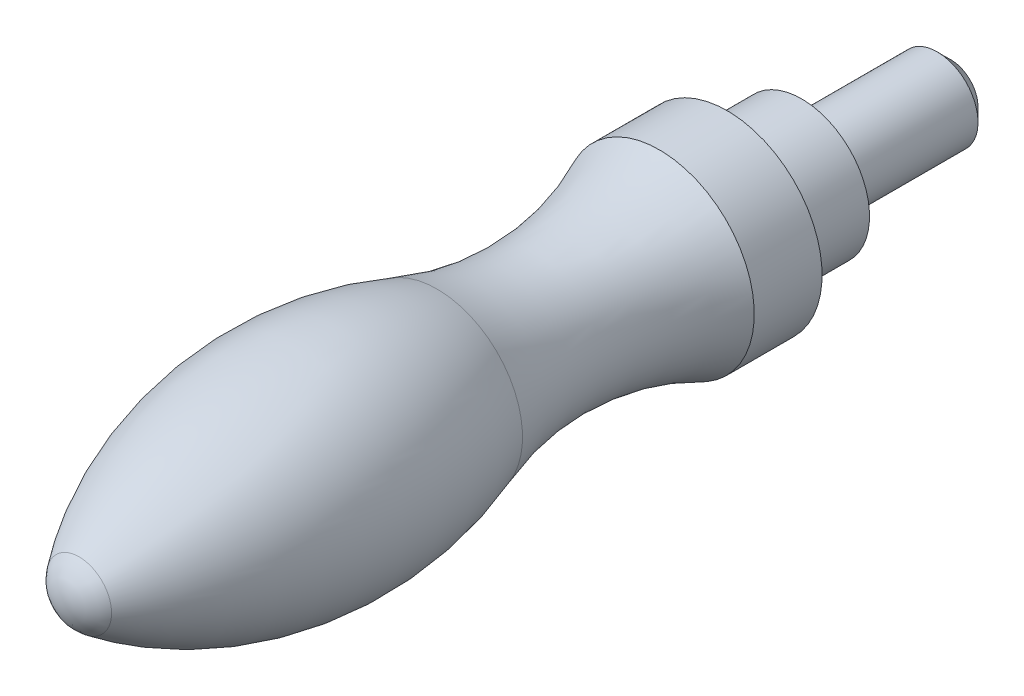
ISO-10303-21;
HEADER;
FILE_DESCRIPTION(('STEP AP214'),'2;1');
FILE_NAME('part.step','',(''),(''),'','','');
FILE_SCHEMA(('AUTOMOTIVE_DESIGN { 1 0 10303 214 1 1 1 1 }'));
ENDSEC;
DATA;
#1=APPLICATION_CONTEXT('core data for automotive mechanical design processes');
#2=APPLICATION_PROTOCOL_DEFINITION('international standard','automotive_design',2000,#1);
#3=PRODUCT_CONTEXT('',#1,'mechanical');
#4=PRODUCT('Part','Part','',(#3));
#5=PRODUCT_RELATED_PRODUCT_CATEGORY('part','',(#4));
#6=PRODUCT_DEFINITION_FORMATION('','',#4);
#7=PRODUCT_DEFINITION_CONTEXT('part definition',#1,'design');
#8=PRODUCT_DEFINITION('design','',#6,#7);
#9=PRODUCT_DEFINITION_SHAPE('','',#8);
#10=(LENGTH_UNIT() NAMED_UNIT(*) SI_UNIT(.MILLI.,.METRE.));
#11=(NAMED_UNIT(*) PLANE_ANGLE_UNIT() SI_UNIT($,.RADIAN.));
#12=(NAMED_UNIT(*) SI_UNIT($,.STERADIAN.) SOLID_ANGLE_UNIT());
#13=UNCERTAINTY_MEASURE_WITH_UNIT(LENGTH_MEASURE(1.E-05),#10,'distance_accuracy_value','');
#14=(GEOMETRIC_REPRESENTATION_CONTEXT(3) GLOBAL_UNCERTAINTY_ASSIGNED_CONTEXT((#13)) GLOBAL_UNIT_ASSIGNED_CONTEXT((#10,
#11,#12)) REPRESENTATION_CONTEXT('',''));
#15=CARTESIAN_POINT('',(0.,0.,0.));
#16=DIRECTION('',(0.,0.,1.));
#17=DIRECTION('',(1.,0.,0.));
#18=AXIS2_PLACEMENT_3D('',#15,#16,#17);
#19=CARTESIAN_POINT('',(0.000499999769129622,0.,51.4999990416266));
#20=DIRECTION('',(0.,-1.,0.));
#21=DIRECTION('',(-1.,0.,0.));
#22=AXIS2_PLACEMENT_3D('',#19,#20,#21);
#23=CIRCLE('',#22,3.00000100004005);
#24=TRIMMED_CURVE('',#23,(PARAMETER_VALUE(-1.57062966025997)),
(PARAMETER_VALUE(1.57062966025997)),.T.,.PARAMETER.);
#25=CARTESIAN_POINT('',(0.,0.,51.4999990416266));
#26=DIRECTION('',(0.,0.,-1.));
#27=AXIS1_PLACEMENT('',#25,#26);
#28=SURFACE_OF_REVOLUTION('',#24,#27);
#29=CARTESIAN_POINT('',(0.,0.,53.299998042));
#30=DIRECTION('',(0.,0.,-1.));
#31=DIRECTION('',(-1.,0.,0.));
#32=AXIS2_PLACEMENT_3D('',#29,#30,#31);
#33=CIRCLE('',#32,2.399502);
#34=CARTESIAN_POINT('',(-2.399502,0.,53.299998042));
#35=VERTEX_POINT('',#34);
#36=EDGE_CURVE('E9',#35,#35,#33,.T.);
#37=ORIENTED_EDGE('',*,*,#36,.F.);
#38=EDGE_LOOP('',(#37));
#39=FACE_BOUND('',#38,.T.);
#40=CARTESIAN_POINT('',(0.,0.,54.5));
#41=VERTEX_POINT('',#40);
#42=VERTEX_LOOP('',#41);
#43=FACE_BOUND('',#42,.T.);
#44=ADVANCED_FACE('F14',(#39,#43),#28,.T.);
#45=CARTESIAN_POINT('',(0.,0.,36.499999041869));
#46=DIRECTION('',(0.,0.,-1.));
#47=DIRECTION('',(-1.,0.,0.));
#48=AXIS2_PLACEMENT_3D('',#45,#46,#47);
#49=DEGENERATE_TOROIDAL_SURFACE('',#48,20.0005000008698,28.0000010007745,.F.);
#50=CARTESIAN_POINT('',(0.,0.,26.894354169));
#51=DIRECTION('',(0.,0.,-1.));
#52=DIRECTION('',(-1.,0.,0.));
#53=AXIS2_PLACEMENT_3D('',#50,#51,#52);
#54=CIRCLE('',#53,6.30029167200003);
#55=CARTESIAN_POINT('',(-6.30029167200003,0.,26.894354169));
#56=VERTEX_POINT('',#55);
#57=EDGE_CURVE('E21',#56,#56,#54,.T.);
#58=ORIENTED_EDGE('',*,*,#57,.F.);
#59=EDGE_LOOP('',(#58));
#60=FACE_BOUND('',#59,.T.);
#61=ORIENTED_EDGE('',*,*,#36,.T.);
#62=EDGE_LOOP('',(#61));
#63=FACE_BOUND('',#62,.T.);
#64=ADVANCED_FACE('F145',(#60,#63),#49,.F.);
#65=CARTESIAN_POINT('',(0.,0.,19.5409677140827));
#66=DIRECTION('',(0.,0.,-1.));
#67=DIRECTION('',(-1.,0.,0.));
#68=AXIS2_PLACEMENT_3D('',#65,#66,#67);
#69=TOROIDAL_SURFACE('',#68,26.4342741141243,21.4347741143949);
#70=CARTESIAN_POINT('',(0.,0.,10.500000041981));
#71=DIRECTION('',(0.,0.,-1.));
#72=DIRECTION('',(-1.,0.,0.));
#73=AXIS2_PLACEMENT_3D('',#70,#71,#72);
#74=CIRCLE('',#73,6.99949999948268);
#75=CARTESIAN_POINT('',(-6.99949999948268,0.,10.500000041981));
#76=VERTEX_POINT('',#75);
#77=EDGE_CURVE('E138',#76,#76,#74,.T.);
#78=ORIENTED_EDGE('',*,*,#77,.F.);
#79=EDGE_LOOP('',(#78));
#80=FACE_BOUND('',#79,.T.);
#81=ORIENTED_EDGE('',*,*,#57,.T.);
#82=EDGE_LOOP('',(#81));
#83=FACE_BOUND('',#82,.T.);
#84=ADVANCED_FACE('F143',(#80,#83),#69,.F.);
#85=CARTESIAN_POINT('',(0.,0.,-17.6175976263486));
#86=DIRECTION('',(0.,0.,-1.));
#87=DIRECTION('',(-1.,0.,0.));
#88=AXIS2_PLACEMENT_3D('',#85,#86,#87);
#89=CYLINDRICAL_SURFACE('',#88,6.99949999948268);
#90=CARTESIAN_POINT('',(0.,0.,5.5));
#91=DIRECTION('',(0.,0.,-1.));
#92=DIRECTION('',(-1.,0.,0.));
#93=AXIS2_PLACEMENT_3D('',#90,#91,#92);
#94=CIRCLE('',#93,6.99949999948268);
#95=CARTESIAN_POINT('',(-6.99949999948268,0.,5.5));
#96=VERTEX_POINT('',#95);
#97=EDGE_CURVE('E135',#96,#96,#94,.T.);
#98=ORIENTED_EDGE('',*,*,#97,.F.);
#99=EDGE_LOOP('',(#98));
#100=FACE_BOUND('',#99,.T.);
#101=ORIENTED_EDGE('',*,*,#77,.T.);
#102=EDGE_LOOP('',(#101));
#103=FACE_BOUND('',#102,.T.);
#104=ADVANCED_FACE('F166',(#100,#103),#89,.T.);
#105=CARTESIAN_POINT('',(0.,6.99949999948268,5.5));
#106=DIRECTION('',(0.,0.,1.));
#107=DIRECTION('',(1.,0.,0.));
#108=AXIS2_PLACEMENT_3D('',#105,#106,#107);
#109=PLANE('',#108);
#110=CARTESIAN_POINT('',(0.,0.,5.5));
#111=DIRECTION('',(0.,0.,-1.));
#112=DIRECTION('',(-1.,0.,0.));
#113=AXIS2_PLACEMENT_3D('',#110,#111,#112);
#114=CIRCLE('',#113,4.9995);
#115=CARTESIAN_POINT('',(-4.9995,0.,5.5));
#116=VERTEX_POINT('',#115);
#117=EDGE_CURVE('E132',#116,#116,#114,.T.);
#118=ORIENTED_EDGE('',*,*,#117,.F.);
#119=EDGE_LOOP('',(#118));
#120=FACE_BOUND('',#119,.T.);
#121=ORIENTED_EDGE('',*,*,#97,.T.);
#122=EDGE_LOOP('',(#121));
#123=FACE_BOUND('',#122,.T.);
#124=ADVANCED_FACE('F174',(#120,#123),#109,.F.);
#125=CARTESIAN_POINT('',(0.,0.,-17.6175976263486));
#126=DIRECTION('',(0.,0.,-1.));
#127=DIRECTION('',(-1.,0.,0.));
#128=AXIS2_PLACEMENT_3D('',#125,#126,#127);
#129=CYLINDRICAL_SURFACE('',#128,4.9995);
#130=CARTESIAN_POINT('',(0.,0.,0.));
#131=DIRECTION('',(0.,0.,-1.));
#132=DIRECTION('',(-1.,0.,0.));
#133=AXIS2_PLACEMENT_3D('',#130,#131,#132);
#134=CIRCLE('',#133,4.9995);
#135=CARTESIAN_POINT('',(-4.9995,0.,0.));
#136=VERTEX_POINT('',#135);
#137=EDGE_CURVE('E129',#136,#136,#134,.T.);
#138=ORIENTED_EDGE('',*,*,#137,.F.);
#139=EDGE_LOOP('',(#138));
#140=FACE_BOUND('',#139,.T.);
#141=ORIENTED_EDGE('',*,*,#117,.T.);
#142=EDGE_LOOP('',(#141));
#143=FACE_BOUND('',#142,.T.);
#144=ADVANCED_FACE('F182',(#140,#143),#129,.T.);
#145=CARTESIAN_POINT('',(0.,4.9995,0.));
#146=DIRECTION('',(0.,0.,1.));
#147=DIRECTION('',(1.,0.,0.));
#148=AXIS2_PLACEMENT_3D('',#145,#146,#147);
#149=PLANE('',#148);
#150=CARTESIAN_POINT('',(0.,0.,0.));
#151=DIRECTION('',(0.,0.,-1.));
#152=DIRECTION('',(-1.,0.,0.));
#153=AXIS2_PLACEMENT_3D('',#150,#151,#152);
#154=CIRCLE('',#153,2.9995);
#155=CARTESIAN_POINT('',(-2.9995,0.,0.));
#156=VERTEX_POINT('',#155);
#157=EDGE_CURVE('E126',#156,#156,#154,.T.);
#158=ORIENTED_EDGE('',*,*,#157,.F.);
#159=EDGE_LOOP('',(#158));
#160=FACE_BOUND('',#159,.T.);
#161=ORIENTED_EDGE('',*,*,#137,.T.);
#162=EDGE_LOOP('',(#161));
#163=FACE_BOUND('',#162,.T.);
#164=ADVANCED_FACE('F190',(#160,#163),#149,.F.);
#165=CARTESIAN_POINT('',(0.,0.,-17.6175976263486));
#166=DIRECTION('',(0.,0.,-1.));
#167=DIRECTION('',(-1.,0.,0.));
#168=AXIS2_PLACEMENT_3D('',#165,#166,#167);
#169=CYLINDRICAL_SURFACE('',#168,2.9995);
#170=CARTESIAN_POINT('',(0.,0.,-10.));
#171=DIRECTION('',(0.,0.,-1.));
#172=DIRECTION('',(-1.,0.,0.));
#173=AXIS2_PLACEMENT_3D('',#170,#171,#172);
#174=CIRCLE('',#173,2.9995);
#175=CARTESIAN_POINT('',(-2.9995,0.,-10.));
#176=VERTEX_POINT('',#175);
#177=EDGE_CURVE('E123',#176,#176,#174,.T.);
#178=ORIENTED_EDGE('',*,*,#177,.F.);
#179=EDGE_LOOP('',(#178));
#180=FACE_BOUND('',#179,.T.);
#181=ORIENTED_EDGE('',*,*,#157,.T.);
#182=EDGE_LOOP('',(#181));
#183=FACE_BOUND('',#182,.T.);
#184=ADVANCED_FACE('F198',(#180,#183),#169,.T.);
#185=CARTESIAN_POINT('',(0.,0.,-10.));
#186=DIRECTION('',(0.,0.,1.));
#187=DIRECTION('',(1.,0.,0.));
#188=AXIS2_PLACEMENT_3D('',#185,#186,#187);
#189=CONICAL_SURFACE('',#188,2.9995,0.78539816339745);
#190=CARTESIAN_POINT('',(0.,0.,-11.));
#191=DIRECTION('',(0.,0.,-1.));
#192=DIRECTION('',(-1.,0.,0.));
#193=AXIS2_PLACEMENT_3D('',#190,#191,#192);
#194=CIRCLE('',#193,1.9995);
#195=CARTESIAN_POINT('',(-1.9995,0.,-11.));
#196=VERTEX_POINT('',#195);
#197=EDGE_CURVE('E113',#196,#196,#194,.T.);
#198=ORIENTED_EDGE('',*,*,#197,.F.);
#199=EDGE_LOOP('',(#198));
#200=FACE_BOUND('',#199,.T.);
#201=ORIENTED_EDGE('',*,*,#177,.T.);
#202=EDGE_LOOP('',(#201));
#203=FACE_BOUND('',#202,.T.);
#204=ADVANCED_FACE('F206',(#200,#203),#189,.T.);
#205=CARTESIAN_POINT('',(0.,1.9995,-11.));
#206=DIRECTION('',(0.,0.,1.));
#207=DIRECTION('',(1.,0.,0.));
#208=AXIS2_PLACEMENT_3D('',#205,#206,#207);
#209=PLANE('',#208);
#210=DIRECTION('',(0.866025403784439,-0.5,0.));
#211=VECTOR('',#210,1.);
#212=CARTESIAN_POINT('',(0.,1.73205080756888,-11.));
#213=LINE('',#212,#211);
#214=CARTESIAN_POINT('',(0.,1.73205080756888,-11.));
#215=VERTEX_POINT('',#214);
#216=CARTESIAN_POINT('',(1.5,0.866025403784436,-11.));
#217=VERTEX_POINT('',#216);
#218=EDGE_CURVE('E101',#215,#217,#213,.T.);
#219=ORIENTED_EDGE('',*,*,#218,.F.);
#220=DIRECTION('',(0.866025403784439,0.5,0.));
#221=VECTOR('',#220,1.);
#222=CARTESIAN_POINT('',(-1.5,0.866025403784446,-11.));
#223=LINE('',#222,#221);
#224=CARTESIAN_POINT('',(-1.5,0.866025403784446,-11.));
#225=VERTEX_POINT('',#224);
#226=EDGE_CURVE('E28',#225,#215,#223,.T.);
#227=ORIENTED_EDGE('',*,*,#226,.F.);
#228=DIRECTION('',(0.,1.,0.));
#229=VECTOR('',#228,1.);
#230=CARTESIAN_POINT('',(-1.5,-0.866025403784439,-11.));
#231=LINE('',#230,#229);
#232=CARTESIAN_POINT('',(-1.5,-0.866025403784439,-11.));
#233=VERTEX_POINT('',#232);
#234=EDGE_CURVE('E87',#233,#225,#231,.T.);
#235=ORIENTED_EDGE('',*,*,#234,.F.);
#236=DIRECTION('',(-0.866025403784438,0.5,0.));
#237=VECTOR('',#236,1.);
#238=CARTESIAN_POINT('',(0.,-1.73205080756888,-11.));
#239=LINE('',#238,#237);
#240=CARTESIAN_POINT('',(0.,-1.73205080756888,-11.));
#241=VERTEX_POINT('',#240);
#242=EDGE_CURVE('E90',#241,#233,#239,.T.);
#243=ORIENTED_EDGE('',*,*,#242,.F.);
#244=DIRECTION('',(-0.866025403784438,-0.5,0.));
#245=VECTOR('',#244,1.);
#246=CARTESIAN_POINT('',(1.5,-0.866025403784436,-11.));
#247=LINE('',#246,#245);
#248=CARTESIAN_POINT('',(1.5,-0.866025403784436,-11.));
#249=VERTEX_POINT('',#248);
#250=EDGE_CURVE('E106',#249,#241,#247,.T.);
#251=ORIENTED_EDGE('',*,*,#250,.F.);
#252=DIRECTION('',(0.,-1.,0.));
#253=VECTOR('',#252,1.);
#254=CARTESIAN_POINT('',(1.5,0.866025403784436,-11.));
#255=LINE('',#254,#253);
#256=EDGE_CURVE('E103',#217,#249,#255,.T.);
#257=ORIENTED_EDGE('',*,*,#256,.F.);
#258=EDGE_LOOP('',(#219,#227,#235,#243,#251,#257));
#259=FACE_BOUND('',#258,.T.);
#260=ORIENTED_EDGE('',*,*,#197,.T.);
#261=EDGE_LOOP('',(#260));
#262=FACE_BOUND('',#261,.T.);
#263=ADVANCED_FACE('F214',(#259,#262),#209,.F.);
#264=CARTESIAN_POINT('',(-1.5,0.866025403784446,-8.));
#265=DIRECTION('',(-0.5,0.866025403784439,0.));
#266=DIRECTION('',(-0.866025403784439,-0.5,0.));
#267=AXIS2_PLACEMENT_3D('',#264,#265,#266);
#268=PLANE('',#267);
#269=ORIENTED_EDGE('',*,*,#226,.T.);
#270=DIRECTION('',(0.,0.,-1.));
#271=VECTOR('',#270,1.);
#272=CARTESIAN_POINT('',(0.,1.73205080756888,-8.));
#273=LINE('',#272,#271);
#274=CARTESIAN_POINT('',(0.,1.73205080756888,-8.));
#275=VERTEX_POINT('',#274);
#276=EDGE_CURVE('E64',#275,#215,#273,.T.);
#277=ORIENTED_EDGE('',*,*,#276,.F.);
#278=DIRECTION('',(0.866025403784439,0.5,0.));
#279=VECTOR('',#278,1.);
#280=CARTESIAN_POINT('',(-1.5,0.866025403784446,-8.));
#281=LINE('',#280,#279);
#282=CARTESIAN_POINT('',(-1.5,0.866025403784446,-8.));
#283=VERTEX_POINT('',#282);
#284=EDGE_CURVE('E68',#283,#275,#281,.T.);
#285=ORIENTED_EDGE('',*,*,#284,.F.);
#286=DIRECTION('',(0.,0.,-1.));
#287=VECTOR('',#286,1.);
#288=CARTESIAN_POINT('',(-1.5,0.866025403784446,-8.));
#289=LINE('',#288,#287);
#290=EDGE_CURVE('E111',#283,#225,#289,.T.);
#291=ORIENTED_EDGE('',*,*,#290,.T.);
#292=EDGE_LOOP('',(#269,#277,#285,#291));
#293=FACE_BOUND('',#292,.T.);
#294=ADVANCED_FACE('F66',(#293),#268,.F.);
#295=CARTESIAN_POINT('',(-1.5,-0.866025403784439,-8.));
#296=DIRECTION('',(-1.,0.,0.));
#297=DIRECTION('',(0.,0.,1.));
#298=AXIS2_PLACEMENT_3D('',#295,#296,#297);
#299=PLANE('',#298);
#300=ORIENTED_EDGE('',*,*,#234,.T.);
#301=ORIENTED_EDGE('',*,*,#290,.F.);
#302=DIRECTION('',(0.,1.,0.));
#303=VECTOR('',#302,1.);
#304=CARTESIAN_POINT('',(-1.5,-0.866025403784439,-8.));
#305=LINE('',#304,#303);
#306=CARTESIAN_POINT('',(-1.5,-0.866025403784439,-8.));
#307=VERTEX_POINT('',#306);
#308=EDGE_CURVE('E74',#307,#283,#305,.T.);
#309=ORIENTED_EDGE('',*,*,#308,.F.);
#310=DIRECTION('',(0.,0.,-1.));
#311=VECTOR('',#310,1.);
#312=CARTESIAN_POINT('',(-1.5,-0.866025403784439,-8.));
#313=LINE('',#312,#311);
#314=EDGE_CURVE('E114',#307,#233,#313,.T.);
#315=ORIENTED_EDGE('',*,*,#314,.T.);
#316=EDGE_LOOP('',(#300,#301,#309,#315));
#317=FACE_BOUND('',#316,.T.);
#318=ADVANCED_FACE('F229',(#317),#299,.F.);
#319=CARTESIAN_POINT('',(0.,-1.73205080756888,-8.));
#320=DIRECTION('',(-0.5,-0.866025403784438,0.));
#321=DIRECTION('',(0.866025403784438,-0.5,0.));
#322=AXIS2_PLACEMENT_3D('',#319,#320,#321);
#323=PLANE('',#322);
#324=ORIENTED_EDGE('',*,*,#242,.T.);
#325=ORIENTED_EDGE('',*,*,#314,.F.);
#326=DIRECTION('',(-0.866025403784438,0.5,0.));
#327=VECTOR('',#326,1.);
#328=CARTESIAN_POINT('',(0.,-1.73205080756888,-8.));
#329=LINE('',#328,#327);
#330=CARTESIAN_POINT('',(0.,-1.73205080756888,-8.));
#331=VERTEX_POINT('',#330);
#332=EDGE_CURVE('E97',#331,#307,#329,.T.);
#333=ORIENTED_EDGE('',*,*,#332,.F.);
#334=DIRECTION('',(0.,0.,-1.));
#335=VECTOR('',#334,1.);
#336=CARTESIAN_POINT('',(0.,-1.73205080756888,-8.));
#337=LINE('',#336,#335);
#338=EDGE_CURVE('E116',#331,#241,#337,.T.);
#339=ORIENTED_EDGE('',*,*,#338,.T.);
#340=EDGE_LOOP('',(#324,#325,#333,#339));
#341=FACE_BOUND('',#340,.T.);
#342=ADVANCED_FACE('F236',(#341),#323,.F.);
#343=CARTESIAN_POINT('',(1.5,-0.866025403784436,-8.));
#344=DIRECTION('',(0.5,-0.866025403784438,0.));
#345=DIRECTION('',(0.866025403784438,0.5,0.));
#346=AXIS2_PLACEMENT_3D('',#343,#344,#345);
#347=PLANE('',#346);
#348=ORIENTED_EDGE('',*,*,#250,.T.);
#349=ORIENTED_EDGE('',*,*,#338,.F.);
#350=DIRECTION('',(-0.866025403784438,-0.5,0.));
#351=VECTOR('',#350,1.);
#352=CARTESIAN_POINT('',(1.5,-0.866025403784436,-8.));
#353=LINE('',#352,#351);
#354=CARTESIAN_POINT('',(1.5,-0.866025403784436,-8.));
#355=VERTEX_POINT('',#354);
#356=EDGE_CURVE('E94',#355,#331,#353,.T.);
#357=ORIENTED_EDGE('',*,*,#356,.F.);
#358=DIRECTION('',(0.,0.,-1.));
#359=VECTOR('',#358,1.);
#360=CARTESIAN_POINT('',(1.5,-0.866025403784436,-8.));
#361=LINE('',#360,#359);
#362=EDGE_CURVE('E118',#355,#249,#361,.T.);
#363=ORIENTED_EDGE('',*,*,#362,.T.);
#364=EDGE_LOOP('',(#348,#349,#357,#363));
#365=FACE_BOUND('',#364,.T.);
#366=ADVANCED_FACE('F244',(#365),#347,.F.);
#367=CARTESIAN_POINT('',(1.5,0.866025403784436,-8.));
#368=DIRECTION('',(1.,0.,0.));
#369=DIRECTION('',(0.,0.,-1.));
#370=AXIS2_PLACEMENT_3D('',#367,#368,#369);
#371=PLANE('',#370);
#372=ORIENTED_EDGE('',*,*,#256,.T.);
#373=ORIENTED_EDGE('',*,*,#362,.F.);
#374=DIRECTION('',(0.,-1.,0.));
#375=VECTOR('',#374,1.);
#376=CARTESIAN_POINT('',(1.5,0.866025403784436,-8.));
#377=LINE('',#376,#375);
#378=CARTESIAN_POINT('',(1.5,0.866025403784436,-8.));
#379=VERTEX_POINT('',#378);
#380=EDGE_CURVE('E82',#379,#355,#377,.T.);
#381=ORIENTED_EDGE('',*,*,#380,.F.);
#382=DIRECTION('',(0.,0.,-1.));
#383=VECTOR('',#382,1.);
#384=CARTESIAN_POINT('',(1.5,0.866025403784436,-8.));
#385=LINE('',#384,#383);
#386=EDGE_CURVE('E73',#379,#217,#385,.T.);
#387=ORIENTED_EDGE('',*,*,#386,.T.);
#388=EDGE_LOOP('',(#372,#373,#381,#387));
#389=FACE_BOUND('',#388,.T.);
#390=ADVANCED_FACE('F252',(#389),#371,.F.);
#391=CARTESIAN_POINT('',(0.,1.73205080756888,-8.));
#392=DIRECTION('',(0.5,0.866025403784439,0.));
#393=DIRECTION('',(-0.866025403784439,0.5,0.));
#394=AXIS2_PLACEMENT_3D('',#391,#392,#393);
#395=PLANE('',#394);
#396=ORIENTED_EDGE('',*,*,#218,.T.);
#397=ORIENTED_EDGE('',*,*,#386,.F.);
#398=DIRECTION('',(0.866025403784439,-0.5,0.));
#399=VECTOR('',#398,1.);
#400=CARTESIAN_POINT('',(0.,1.73205080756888,-8.));
#401=LINE('',#400,#399);
#402=EDGE_CURVE('E77',#275,#379,#401,.T.);
#403=ORIENTED_EDGE('',*,*,#402,.F.);
#404=ORIENTED_EDGE('',*,*,#276,.T.);
#405=EDGE_LOOP('',(#396,#397,#403,#404));
#406=FACE_BOUND('',#405,.T.);
#407=ADVANCED_FACE('F78',(#406),#395,.F.);
#408=CARTESIAN_POINT('',(0.,-19.1551208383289,-8.));
#409=DIRECTION('',(0.,0.,-1.));
#410=DIRECTION('',(-1.,0.,0.));
#411=AXIS2_PLACEMENT_3D('',#408,#409,#410);
#412=PLANE('',#411);
#413=ORIENTED_EDGE('',*,*,#284,.T.);
#414=ORIENTED_EDGE('',*,*,#402,.T.);
#415=ORIENTED_EDGE('',*,*,#380,.T.);
#416=ORIENTED_EDGE('',*,*,#356,.T.);
#417=ORIENTED_EDGE('',*,*,#332,.T.);
#418=ORIENTED_EDGE('',*,*,#308,.T.);
#419=EDGE_LOOP('',(#413,#414,#415,#416,#417,#418));
#420=FACE_BOUND('',#419,.T.);
#421=ADVANCED_FACE('F84',(#420),#412,.T.);
#422=CLOSED_SHELL('',(#44,#64,#84,#104,#124,#144,#164,#184,#204,#263,#294,#318,#342,#366,#390,
#407,#421));
#423=MANIFOLD_SOLID_BREP('B1',#422);
#424=ADVANCED_BREP_SHAPE_REPRESENTATION('',(#18,#423),#14);
#425=SHAPE_DEFINITION_REPRESENTATION(#9,#424);
ENDSEC;
END-ISO-10303-21;
